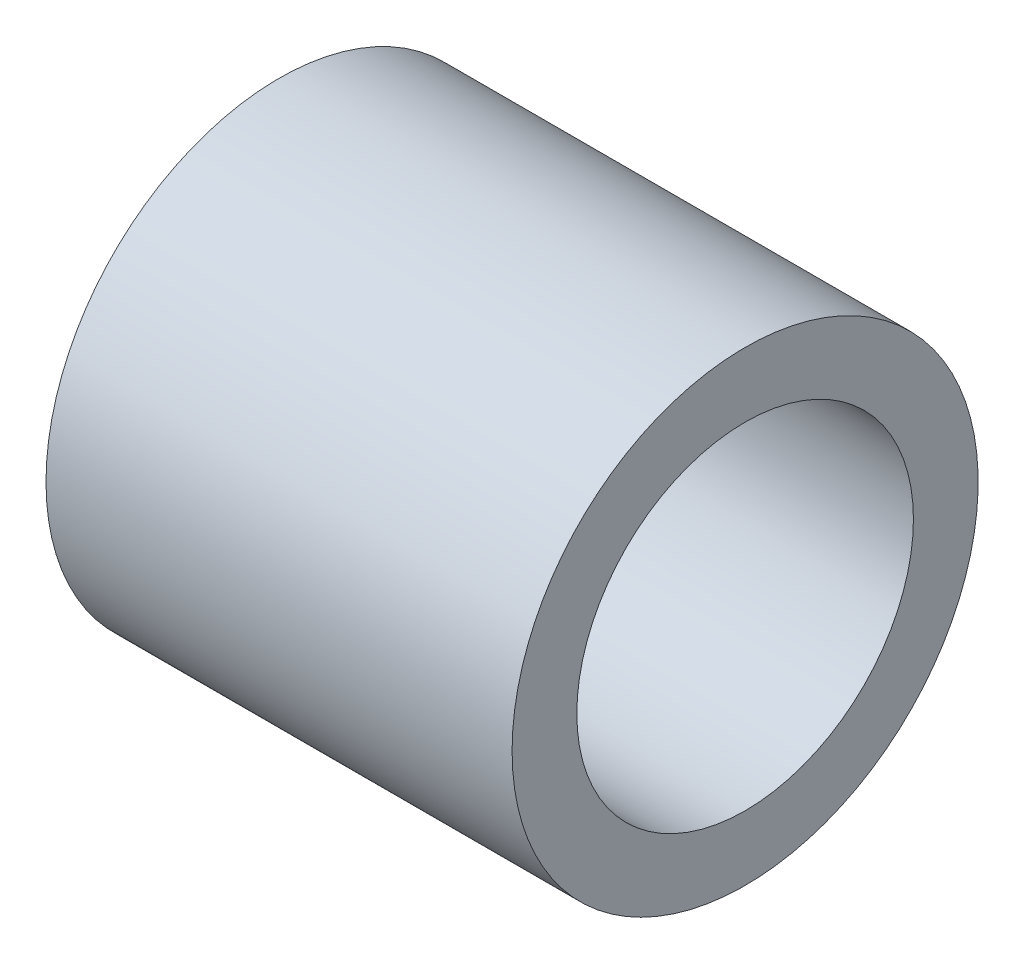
from build123d import *

# Parameters (mm, degrees)
SKETCH2_W = 9
SKETCH2_H = 3.25


with BuildPart() as part:
    # Sketch1 → Revolve1 (revolve)
    with BuildSketch(Plane.XY, mode=Mode.PRIVATE) as revolve1_sk:
        Polygon((0, 4.5), (9, 4.5), (9, 3.25), (9, 0), (0, 0), (0, 3.25), align=None)
    revolve(revolve1_sk.sketch.rotate(Axis((0, 0, 0), (1, 0, 0)), 90), axis=Axis((0, 0, 0), (1, 0, 0)))

    # Sketch2 → Cut-Revolve1 (revolve, cut)
    with BuildSketch(Plane.XY, mode=Mode.PRIVATE) as cut_revolve1_sk:
        with Locations((4.5, 1.625)):
            Rectangle(SKETCH2_W, SKETCH2_H)
    revolve(cut_revolve1_sk.sketch.rotate(Axis((0, 0, 0), (1, 0, 0)), 90), axis=Axis((0, 0, 0), (1, 0, 0)), mode=Mode.SUBTRACT)


solid = part.part
